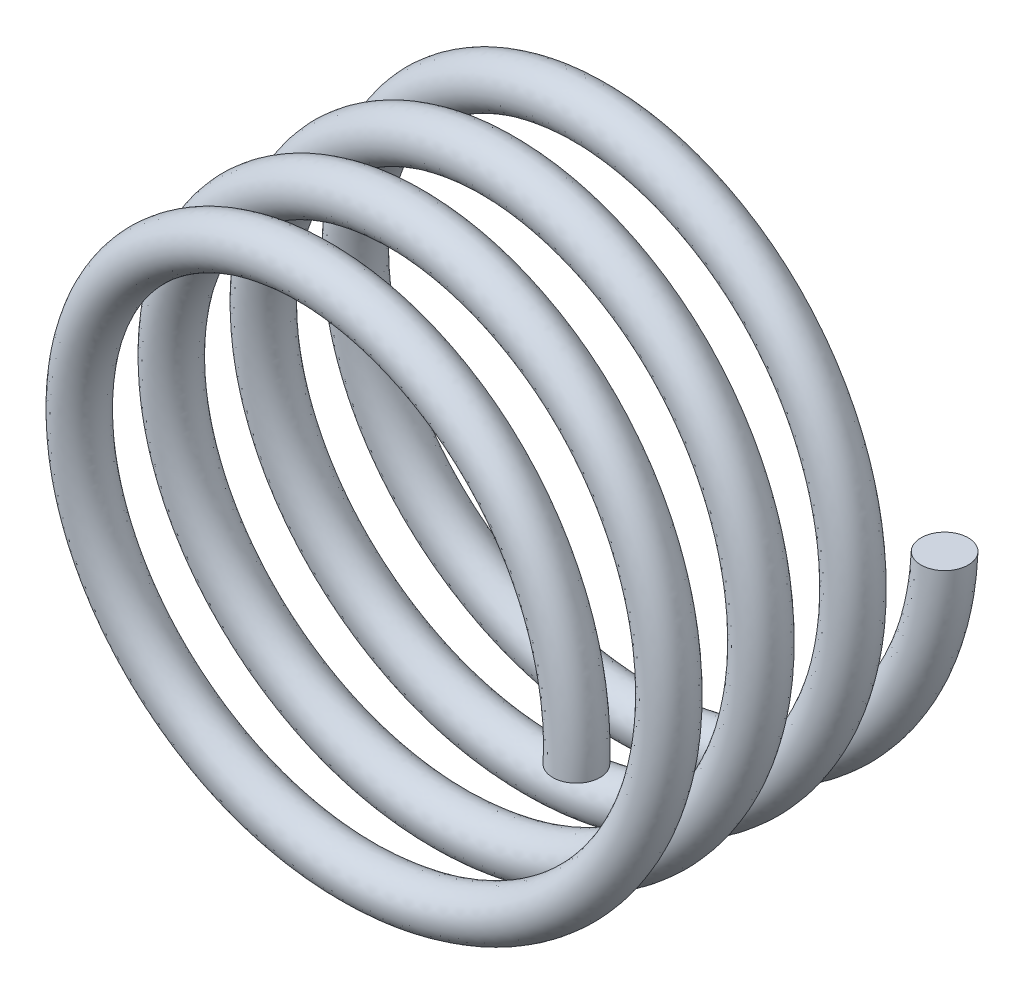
ISO-10303-21;
HEADER;
FILE_DESCRIPTION(('STEP AP214'),'2;1');
FILE_NAME('part.step','',(''),(''),'','','');
FILE_SCHEMA(('AUTOMOTIVE_DESIGN { 1 0 10303 214 1 1 1 1 }'));
ENDSEC;
DATA;
#1=APPLICATION_CONTEXT('core data for automotive mechanical design processes');
#2=APPLICATION_PROTOCOL_DEFINITION('international standard','automotive_design',2000,#1);
#3=PRODUCT_CONTEXT('',#1,'mechanical');
#4=PRODUCT('Part','Part','',(#3));
#5=PRODUCT_RELATED_PRODUCT_CATEGORY('part','',(#4));
#6=PRODUCT_DEFINITION_FORMATION('','',#4);
#7=PRODUCT_DEFINITION_CONTEXT('part definition',#1,'design');
#8=PRODUCT_DEFINITION('design','',#6,#7);
#9=PRODUCT_DEFINITION_SHAPE('','',#8);
#10=(LENGTH_UNIT() NAMED_UNIT(*) SI_UNIT(.MILLI.,.METRE.));
#11=(NAMED_UNIT(*) PLANE_ANGLE_UNIT() SI_UNIT($,.RADIAN.));
#12=(NAMED_UNIT(*) SI_UNIT($,.STERADIAN.) SOLID_ANGLE_UNIT());
#13=UNCERTAINTY_MEASURE_WITH_UNIT(LENGTH_MEASURE(1.E-05),#10,'distance_accuracy_value','');
#14=(GEOMETRIC_REPRESENTATION_CONTEXT(3) GLOBAL_UNCERTAINTY_ASSIGNED_CONTEXT((#13)) GLOBAL_UNIT_ASSIGNED_CONTEXT((#10,
#11,#12)) REPRESENTATION_CONTEXT('',''));
#15=CARTESIAN_POINT('',(0.,0.,0.));
#16=DIRECTION('',(0.,0.,1.));
#17=DIRECTION('',(1.,0.,0.));
#18=AXIS2_PLACEMENT_3D('',#15,#16,#17);
#19=CARTESIAN_POINT('',(8.763,0.,0.));
#20=DIRECTION('',(0.,1.,0.));
#21=DIRECTION('',(0.,0.,1.));
#22=AXIS2_PLACEMENT_3D('',#19,#20,#21);
#23=PLANE('',#22);
#24=CARTESIAN_POINT('',(8.763,0.,0.));
#25=DIRECTION('',(0.,1.,0.));
#26=DIRECTION('',(0.,0.,1.));
#27=AXIS2_PLACEMENT_3D('',#24,#25,#26);
#28=CIRCLE('',#27,0.762000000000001);
#29=CARTESIAN_POINT('',(8.763,0.,0.762000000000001));
#30=VERTEX_POINT('',#29);
#31=EDGE_CURVE('E37',#30,#30,#28,.T.);
#32=ORIENTED_EDGE('',*,*,#31,.T.);
#33=EDGE_LOOP('',(#32));
#34=FACE_BOUND('',#33,.T.);
#35=ADVANCED_FACE('F30',(#34),#23,.T.);
#36=CARTESIAN_POINT('',(8.763,-4.89533899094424E-13,11.8872));
#37=DIRECTION('',(0.,1.,0.));
#38=DIRECTION('',(0.,0.,1.));
#39=AXIS2_PLACEMENT_3D('',#36,#37,#38);
#40=PLANE('',#39);
#41=CARTESIAN_POINT('',(8.763,-4.89533899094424E-13,11.8872));
#42=DIRECTION('',(0.,1.,0.));
#43=DIRECTION('',(0.,0.,1.));
#44=AXIS2_PLACEMENT_3D('',#41,#42,#43);
#45=CIRCLE('',#44,0.762000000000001);
#46=CARTESIAN_POINT('',(8.763,-4.89533899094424E-13,12.6492));
#47=VERTEX_POINT('',#46);
#48=EDGE_CURVE('E11',#47,#47,#45,.T.);
#49=ORIENTED_EDGE('',*,*,#48,.F.);
#50=EDGE_LOOP('',(#49));
#51=FACE_BOUND('',#50,.T.);
#52=ADVANCED_FACE('F46',(#51),#40,.F.);
#53=CARTESIAN_POINT('',(8.763,0.,0.762000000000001));
#54=CARTESIAN_POINT('',(8.763,-5.05932040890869,1.00965));
#55=CARTESIAN_POINT('',(4.3815,-7.58898061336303,1.2573));
#56=CARTESIAN_POINT('',(0.,-10.1186408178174,1.50495));
#57=CARTESIAN_POINT('',(-4.3815,-7.58898061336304,1.7526));
#58=CARTESIAN_POINT('',(-8.76299999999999,-5.05932040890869,2.00025));
#59=CARTESIAN_POINT('',(-8.763,0.,2.2479));
#60=CARTESIAN_POINT('',(-8.763,5.05932040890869,2.49555));
#61=CARTESIAN_POINT('',(-4.3815,7.58898061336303,2.7432));
#62=CARTESIAN_POINT('',(0.,10.1186408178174,2.99085));
#63=CARTESIAN_POINT('',(4.38149999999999,7.58898061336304,3.2385));
#64=CARTESIAN_POINT('',(8.76299999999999,5.05932040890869,3.48614999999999));
#65=CARTESIAN_POINT('',(8.763,0.,3.7338));
#66=CARTESIAN_POINT('',(8.763,-5.05932040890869,3.98144999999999));
#67=CARTESIAN_POINT('',(4.3815,-7.58898061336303,4.22909999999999));
#68=CARTESIAN_POINT('',(0.,-10.1186408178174,4.47674999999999));
#69=CARTESIAN_POINT('',(-4.3815,-7.58898061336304,4.72439999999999));
#70=CARTESIAN_POINT('',(-8.76299999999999,-5.05932040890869,4.97204999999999));
#71=CARTESIAN_POINT('',(-8.763,0.,5.21969999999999));
#72=CARTESIAN_POINT('',(-8.763,5.05932040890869,5.46734999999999));
#73=CARTESIAN_POINT('',(-4.3815,7.58898061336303,5.71499999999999));
#74=CARTESIAN_POINT('',(0.,10.1186408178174,5.96264999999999));
#75=CARTESIAN_POINT('',(4.38149999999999,7.58898061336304,6.21029999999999));
#76=CARTESIAN_POINT('',(8.76299999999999,5.05932040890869,6.45794999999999));
#77=CARTESIAN_POINT('',(8.763,0.,6.70559999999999));
#78=CARTESIAN_POINT('',(8.763,-5.05932040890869,6.95324999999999));
#79=CARTESIAN_POINT('',(4.3815,-7.58898061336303,7.20089999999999));
#80=CARTESIAN_POINT('',(0.,-10.1186408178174,7.44854999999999));
#81=CARTESIAN_POINT('',(-4.3815,-7.58898061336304,7.69619999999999));
#82=CARTESIAN_POINT('',(-8.76299999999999,-5.05932040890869,7.94384999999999));
#83=CARTESIAN_POINT('',(-8.763,0.,8.19149999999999));
#84=CARTESIAN_POINT('',(-8.763,5.05932040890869,8.43914999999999));
#85=CARTESIAN_POINT('',(-4.3815,7.58898061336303,8.68679999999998));
#86=CARTESIAN_POINT('',(0.,10.1186408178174,8.93444999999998));
#87=CARTESIAN_POINT('',(4.38149999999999,7.58898061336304,9.18209999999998));
#88=CARTESIAN_POINT('',(8.76299999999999,5.05932040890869,9.42974999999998));
#89=CARTESIAN_POINT('',(8.763,0.,9.67739999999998));
#90=CARTESIAN_POINT('',(8.763,-5.05932040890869,9.92504999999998));
#91=CARTESIAN_POINT('',(4.3815,-7.58898061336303,10.1727));
#92=CARTESIAN_POINT('',(0.,-10.1186408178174,10.42035));
#93=CARTESIAN_POINT('',(-4.3815,-7.58898061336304,10.668));
#94=CARTESIAN_POINT('',(-8.76299999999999,-5.05932040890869,10.91565));
#95=CARTESIAN_POINT('',(-8.763,0.,11.1633));
#96=CARTESIAN_POINT('',(-8.763,5.05932040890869,11.41095));
#97=CARTESIAN_POINT('',(-4.3815,7.58898061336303,11.6586));
#98=CARTESIAN_POINT('',(0.,10.1186408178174,11.90625));
#99=CARTESIAN_POINT('',(4.38149999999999,7.58898061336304,12.1539));
#100=CARTESIAN_POINT('',(8.76299999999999,5.05932040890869,12.40155));
#101=CARTESIAN_POINT('',(8.763,0.,12.6492));
#102=CARTESIAN_POINT('',(10.287,0.,0.762000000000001));
#103=CARTESIAN_POINT('',(10.287,-5.93920221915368,1.00965));
#104=CARTESIAN_POINT('',(5.1435,-8.90880332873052,1.2573));
#105=CARTESIAN_POINT('',(0.,-11.8784044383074,1.50495));
#106=CARTESIAN_POINT('',(-5.1435,-8.90880332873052,1.7526));
#107=CARTESIAN_POINT('',(-10.287,-5.93920221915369,2.00025));
#108=CARTESIAN_POINT('',(-10.287,0.,2.2479));
#109=CARTESIAN_POINT('',(-10.287,5.93920221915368,2.49555));
#110=CARTESIAN_POINT('',(-5.1435,8.90880332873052,2.7432));
#111=CARTESIAN_POINT('',(0.,11.8784044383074,2.99085));
#112=CARTESIAN_POINT('',(5.14349999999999,8.90880332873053,3.2385));
#113=CARTESIAN_POINT('',(10.287,5.93920221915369,3.48615));
#114=CARTESIAN_POINT('',(10.287,0.,3.7338));
#115=CARTESIAN_POINT('',(10.287,-5.93920221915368,3.98144999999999));
#116=CARTESIAN_POINT('',(5.1435,-8.90880332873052,4.22909999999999));
#117=CARTESIAN_POINT('',(0.,-11.8784044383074,4.47674999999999));
#118=CARTESIAN_POINT('',(-5.1435,-8.90880332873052,4.72439999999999));
#119=CARTESIAN_POINT('',(-10.287,-5.93920221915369,4.97204999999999));
#120=CARTESIAN_POINT('',(-10.287,0.,5.21969999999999));
#121=CARTESIAN_POINT('',(-10.287,5.93920221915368,5.46734999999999));
#122=CARTESIAN_POINT('',(-5.1435,8.90880332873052,5.71499999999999));
#123=CARTESIAN_POINT('',(0.,11.8784044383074,5.96264999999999));
#124=CARTESIAN_POINT('',(5.14349999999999,8.90880332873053,6.21029999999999));
#125=CARTESIAN_POINT('',(10.287,5.93920221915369,6.45794999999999));
#126=CARTESIAN_POINT('',(10.287,0.,6.70559999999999));
#127=CARTESIAN_POINT('',(10.287,-5.93920221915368,6.95324999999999));
#128=CARTESIAN_POINT('',(5.1435,-8.90880332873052,7.20089999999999));
#129=CARTESIAN_POINT('',(0.,-11.8784044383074,7.44854999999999));
#130=CARTESIAN_POINT('',(-5.1435,-8.90880332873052,7.69619999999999));
#131=CARTESIAN_POINT('',(-10.287,-5.93920221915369,7.94384999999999));
#132=CARTESIAN_POINT('',(-10.287,0.,8.19149999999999));
#133=CARTESIAN_POINT('',(-10.287,5.93920221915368,8.43914999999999));
#134=CARTESIAN_POINT('',(-5.1435,8.90880332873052,8.68679999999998));
#135=CARTESIAN_POINT('',(0.,11.8784044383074,8.93444999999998));
#136=CARTESIAN_POINT('',(5.14349999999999,8.90880332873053,9.18209999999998));
#137=CARTESIAN_POINT('',(10.287,5.93920221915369,9.42974999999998));
#138=CARTESIAN_POINT('',(10.287,0.,9.67739999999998));
#139=CARTESIAN_POINT('',(10.287,-5.93920221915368,9.92504999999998));
#140=CARTESIAN_POINT('',(5.1435,-8.90880332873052,10.1727));
#141=CARTESIAN_POINT('',(0.,-11.8784044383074,10.42035));
#142=CARTESIAN_POINT('',(-5.1435,-8.90880332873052,10.668));
#143=CARTESIAN_POINT('',(-10.287,-5.93920221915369,10.91565));
#144=CARTESIAN_POINT('',(-10.287,0.,11.1633));
#145=CARTESIAN_POINT('',(-10.287,5.93920221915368,11.41095));
#146=CARTESIAN_POINT('',(-5.1435,8.90880332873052,11.6586));
#147=CARTESIAN_POINT('',(0.,11.8784044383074,11.90625));
#148=CARTESIAN_POINT('',(5.14349999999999,8.90880332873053,12.1539));
#149=CARTESIAN_POINT('',(10.287,5.93920221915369,12.40155));
#150=CARTESIAN_POINT('',(10.287,0.,12.6492));
#151=CARTESIAN_POINT('',(10.287,0.,-0.762000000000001));
#152=CARTESIAN_POINT('',(10.287,-5.93920221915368,-0.514350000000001));
#153=CARTESIAN_POINT('',(5.1435,-8.90880332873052,-0.266700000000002));
#154=CARTESIAN_POINT('',(0.,-11.8784044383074,-0.0190500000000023));
#155=CARTESIAN_POINT('',(-5.1435,-8.90880332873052,0.228599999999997));
#156=CARTESIAN_POINT('',(-10.287,-5.93920221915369,0.476249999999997));
#157=CARTESIAN_POINT('',(-10.287,0.,0.723899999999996));
#158=CARTESIAN_POINT('',(-10.287,5.93920221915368,0.971549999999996));
#159=CARTESIAN_POINT('',(-5.1435,8.90880332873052,1.21919999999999));
#160=CARTESIAN_POINT('',(0.,11.8784044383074,1.46684999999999));
#161=CARTESIAN_POINT('',(5.14349999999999,8.90880332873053,1.71449999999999));
#162=CARTESIAN_POINT('',(10.287,5.93920221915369,1.96214999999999));
#163=CARTESIAN_POINT('',(10.287,0.,2.20979999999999));
#164=CARTESIAN_POINT('',(10.287,-5.93920221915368,2.45744999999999));
#165=CARTESIAN_POINT('',(5.1435,-8.90880332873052,2.70509999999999));
#166=CARTESIAN_POINT('',(0.,-11.8784044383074,2.95274999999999));
#167=CARTESIAN_POINT('',(-5.1435,-8.90880332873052,3.20039999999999));
#168=CARTESIAN_POINT('',(-10.287,-5.93920221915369,3.44804999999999));
#169=CARTESIAN_POINT('',(-10.287,0.,3.69569999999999));
#170=CARTESIAN_POINT('',(-10.287,5.93920221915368,3.94334999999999));
#171=CARTESIAN_POINT('',(-5.1435,8.90880332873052,4.19099999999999));
#172=CARTESIAN_POINT('',(0.,11.8784044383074,4.43864999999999));
#173=CARTESIAN_POINT('',(5.14349999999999,8.90880332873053,4.68629999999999));
#174=CARTESIAN_POINT('',(10.287,5.93920221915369,4.93394999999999));
#175=CARTESIAN_POINT('',(10.287,0.,5.18159999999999));
#176=CARTESIAN_POINT('',(10.287,-5.93920221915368,5.42924999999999));
#177=CARTESIAN_POINT('',(5.1435,-8.90880332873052,5.67689999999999));
#178=CARTESIAN_POINT('',(0.,-11.8784044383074,5.92454999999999));
#179=CARTESIAN_POINT('',(-5.1435,-8.90880332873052,6.17219999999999));
#180=CARTESIAN_POINT('',(-10.287,-5.93920221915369,6.41984999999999));
#181=CARTESIAN_POINT('',(-10.287,0.,6.66749999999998));
#182=CARTESIAN_POINT('',(-10.287,5.93920221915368,6.91514999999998));
#183=CARTESIAN_POINT('',(-5.1435,8.90880332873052,7.16279999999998));
#184=CARTESIAN_POINT('',(0.,11.8784044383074,7.41044999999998));
#185=CARTESIAN_POINT('',(5.14349999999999,8.90880332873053,7.65809999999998));
#186=CARTESIAN_POINT('',(10.287,5.93920221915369,7.90574999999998));
#187=CARTESIAN_POINT('',(10.287,0.,8.15339999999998));
#188=CARTESIAN_POINT('',(10.287,-5.93920221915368,8.40104999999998));
#189=CARTESIAN_POINT('',(5.1435,-8.90880332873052,8.64869999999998));
#190=CARTESIAN_POINT('',(0.,-11.8784044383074,8.89634999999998));
#191=CARTESIAN_POINT('',(-5.1435,-8.90880332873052,9.14399999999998));
#192=CARTESIAN_POINT('',(-10.287,-5.93920221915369,9.39164999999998));
#193=CARTESIAN_POINT('',(-10.287,0.,9.63929999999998));
#194=CARTESIAN_POINT('',(-10.287,5.93920221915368,9.88694999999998));
#195=CARTESIAN_POINT('',(-5.1435,8.90880332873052,10.1346));
#196=CARTESIAN_POINT('',(0.,11.8784044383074,10.38225));
#197=CARTESIAN_POINT('',(5.14349999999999,8.90880332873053,10.6299));
#198=CARTESIAN_POINT('',(10.287,5.93920221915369,10.87755));
#199=CARTESIAN_POINT('',(10.287,0.,11.1252));
#200=CARTESIAN_POINT('',(8.763,0.,-0.762000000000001));
#201=CARTESIAN_POINT('',(8.763,-5.05932040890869,-0.514350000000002));
#202=CARTESIAN_POINT('',(4.3815,-7.58898061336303,-0.266700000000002));
#203=CARTESIAN_POINT('',(0.,-10.1186408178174,-0.0190500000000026));
#204=CARTESIAN_POINT('',(-4.3815,-7.58898061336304,0.228599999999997));
#205=CARTESIAN_POINT('',(-8.76299999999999,-5.05932040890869,0.476249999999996));
#206=CARTESIAN_POINT('',(-8.763,0.,0.723899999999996));
#207=CARTESIAN_POINT('',(-8.763,5.05932040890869,0.971549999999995));
#208=CARTESIAN_POINT('',(-4.3815,7.58898061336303,1.21919999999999));
#209=CARTESIAN_POINT('',(0.,10.1186408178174,1.46684999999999));
#210=CARTESIAN_POINT('',(4.38149999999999,7.58898061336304,1.71449999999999));
#211=CARTESIAN_POINT('',(8.76299999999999,5.05932040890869,1.96214999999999));
#212=CARTESIAN_POINT('',(8.763,0.,2.20979999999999));
#213=CARTESIAN_POINT('',(8.763,-5.05932040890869,2.45744999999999));
#214=CARTESIAN_POINT('',(4.3815,-7.58898061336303,2.70509999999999));
#215=CARTESIAN_POINT('',(0.,-10.1186408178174,2.95274999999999));
#216=CARTESIAN_POINT('',(-4.3815,-7.58898061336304,3.20039999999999));
#217=CARTESIAN_POINT('',(-8.76299999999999,-5.05932040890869,3.44804999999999));
#218=CARTESIAN_POINT('',(-8.763,0.,3.69569999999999));
#219=CARTESIAN_POINT('',(-8.763,5.05932040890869,3.94334999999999));
#220=CARTESIAN_POINT('',(-4.3815,7.58898061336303,4.19099999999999));
#221=CARTESIAN_POINT('',(0.,10.1186408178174,4.43864999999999));
#222=CARTESIAN_POINT('',(4.38149999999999,7.58898061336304,4.68629999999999));
#223=CARTESIAN_POINT('',(8.76299999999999,5.05932040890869,4.93394999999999));
#224=CARTESIAN_POINT('',(8.763,0.,5.18159999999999));
#225=CARTESIAN_POINT('',(8.763,-5.05932040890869,5.42924999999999));
#226=CARTESIAN_POINT('',(4.3815,-7.58898061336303,5.67689999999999));
#227=CARTESIAN_POINT('',(0.,-10.1186408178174,5.92454999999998));
#228=CARTESIAN_POINT('',(-4.3815,-7.58898061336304,6.17219999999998));
#229=CARTESIAN_POINT('',(-8.76299999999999,-5.05932040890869,6.41984999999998));
#230=CARTESIAN_POINT('',(-8.763,0.,6.66749999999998));
#231=CARTESIAN_POINT('',(-8.763,5.05932040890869,6.91514999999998));
#232=CARTESIAN_POINT('',(-4.3815,7.58898061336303,7.16279999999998));
#233=CARTESIAN_POINT('',(0.,10.1186408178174,7.41044999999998));
#234=CARTESIAN_POINT('',(4.38149999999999,7.58898061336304,7.65809999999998));
#235=CARTESIAN_POINT('',(8.76299999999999,5.05932040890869,7.90574999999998));
#236=CARTESIAN_POINT('',(8.763,0.,8.15339999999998));
#237=CARTESIAN_POINT('',(8.763,-5.05932040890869,8.40104999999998));
#238=CARTESIAN_POINT('',(4.3815,-7.58898061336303,8.64869999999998));
#239=CARTESIAN_POINT('',(0.,-10.1186408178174,8.89634999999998));
#240=CARTESIAN_POINT('',(-4.3815,-7.58898061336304,9.14399999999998));
#241=CARTESIAN_POINT('',(-8.76299999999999,-5.05932040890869,9.39164999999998));
#242=CARTESIAN_POINT('',(-8.763,0.,9.63929999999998));
#243=CARTESIAN_POINT('',(-8.763,5.05932040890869,9.88694999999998));
#244=CARTESIAN_POINT('',(-4.3815,7.58898061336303,10.1346));
#245=CARTESIAN_POINT('',(0.,10.1186408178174,10.38225));
#246=CARTESIAN_POINT('',(4.38149999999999,7.58898061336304,10.6299));
#247=CARTESIAN_POINT('',(8.76299999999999,5.05932040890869,10.87755));
#248=CARTESIAN_POINT('',(8.763,0.,11.1252));
#249=CARTESIAN_POINT('',(7.239,0.,-0.762000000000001));
#250=CARTESIAN_POINT('',(7.239,-4.1794385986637,-0.514350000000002));
#251=CARTESIAN_POINT('',(3.6195,-6.26915789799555,-0.266700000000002));
#252=CARTESIAN_POINT('',(0.,-8.3588771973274,-0.0190500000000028));
#253=CARTESIAN_POINT('',(-3.6195,-6.26915789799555,0.228599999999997));
#254=CARTESIAN_POINT('',(-7.23899999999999,-4.1794385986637,0.476249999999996));
#255=CARTESIAN_POINT('',(-7.239,0.,0.723899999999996));
#256=CARTESIAN_POINT('',(-7.239,4.1794385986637,0.971549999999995));
#257=CARTESIAN_POINT('',(-3.6195,6.26915789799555,1.21919999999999));
#258=CARTESIAN_POINT('',(0.,8.3588771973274,1.46684999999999));
#259=CARTESIAN_POINT('',(3.61949999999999,6.26915789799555,1.71449999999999));
#260=CARTESIAN_POINT('',(7.23899999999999,4.1794385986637,1.96214999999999));
#261=CARTESIAN_POINT('',(7.239,0.,2.20979999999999));
#262=CARTESIAN_POINT('',(7.239,-4.1794385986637,2.45744999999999));
#263=CARTESIAN_POINT('',(3.6195,-6.26915789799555,2.70509999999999));
#264=CARTESIAN_POINT('',(0.,-8.3588771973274,2.95274999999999));
#265=CARTESIAN_POINT('',(-3.6195,-6.26915789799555,3.20039999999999));
#266=CARTESIAN_POINT('',(-7.23899999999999,-4.1794385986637,3.44804999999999));
#267=CARTESIAN_POINT('',(-7.239,0.,3.69569999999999));
#268=CARTESIAN_POINT('',(-7.239,4.1794385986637,3.94334999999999));
#269=CARTESIAN_POINT('',(-3.6195,6.26915789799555,4.19099999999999));
#270=CARTESIAN_POINT('',(0.,8.3588771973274,4.43864999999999));
#271=CARTESIAN_POINT('',(3.61949999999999,6.26915789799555,4.68629999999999));
#272=CARTESIAN_POINT('',(7.23899999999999,4.1794385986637,4.93394999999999));
#273=CARTESIAN_POINT('',(7.239,0.,5.18159999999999));
#274=CARTESIAN_POINT('',(7.239,-4.1794385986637,5.42924999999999));
#275=CARTESIAN_POINT('',(3.6195,-6.26915789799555,5.67689999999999));
#276=CARTESIAN_POINT('',(0.,-8.3588771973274,5.92454999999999));
#277=CARTESIAN_POINT('',(-3.6195,-6.26915789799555,6.17219999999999));
#278=CARTESIAN_POINT('',(-7.23899999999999,-4.1794385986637,6.41984999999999));
#279=CARTESIAN_POINT('',(-7.239,0.,6.66749999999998));
#280=CARTESIAN_POINT('',(-7.239,4.1794385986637,6.91514999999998));
#281=CARTESIAN_POINT('',(-3.6195,6.26915789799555,7.16279999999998));
#282=CARTESIAN_POINT('',(0.,8.3588771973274,7.41044999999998));
#283=CARTESIAN_POINT('',(3.61949999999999,6.26915789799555,7.65809999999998));
#284=CARTESIAN_POINT('',(7.23899999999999,4.1794385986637,7.90574999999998));
#285=CARTESIAN_POINT('',(7.239,0.,8.15339999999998));
#286=CARTESIAN_POINT('',(7.239,-4.1794385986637,8.40104999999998));
#287=CARTESIAN_POINT('',(3.6195,-6.26915789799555,8.64869999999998));
#288=CARTESIAN_POINT('',(0.,-8.3588771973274,8.89634999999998));
#289=CARTESIAN_POINT('',(-3.6195,-6.26915789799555,9.14399999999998));
#290=CARTESIAN_POINT('',(-7.23899999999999,-4.1794385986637,9.39164999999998));
#291=CARTESIAN_POINT('',(-7.239,0.,9.63929999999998));
#292=CARTESIAN_POINT('',(-7.239,4.1794385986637,9.88694999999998));
#293=CARTESIAN_POINT('',(-3.6195,6.26915789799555,10.1346));
#294=CARTESIAN_POINT('',(0.,8.3588771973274,10.38225));
#295=CARTESIAN_POINT('',(3.61949999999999,6.26915789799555,10.6299));
#296=CARTESIAN_POINT('',(7.23899999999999,4.1794385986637,10.87755));
#297=CARTESIAN_POINT('',(7.239,0.,11.1252));
#298=CARTESIAN_POINT('',(7.239,0.,0.762000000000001));
#299=CARTESIAN_POINT('',(7.239,-4.1794385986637,1.00965));
#300=CARTESIAN_POINT('',(3.6195,-6.26915789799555,1.2573));
#301=CARTESIAN_POINT('',(0.,-8.3588771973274,1.50495));
#302=CARTESIAN_POINT('',(-3.6195,-6.26915789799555,1.7526));
#303=CARTESIAN_POINT('',(-7.23899999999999,-4.1794385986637,2.00025));
#304=CARTESIAN_POINT('',(-7.239,0.,2.2479));
#305=CARTESIAN_POINT('',(-7.239,4.1794385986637,2.49555));
#306=CARTESIAN_POINT('',(-3.6195,6.26915789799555,2.7432));
#307=CARTESIAN_POINT('',(0.,8.3588771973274,2.99085));
#308=CARTESIAN_POINT('',(3.61949999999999,6.26915789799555,3.2385));
#309=CARTESIAN_POINT('',(7.23899999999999,4.1794385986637,3.48615));
#310=CARTESIAN_POINT('',(7.239,0.,3.7338));
#311=CARTESIAN_POINT('',(7.239,-4.1794385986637,3.98144999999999));
#312=CARTESIAN_POINT('',(3.6195,-6.26915789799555,4.22909999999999));
#313=CARTESIAN_POINT('',(0.,-8.3588771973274,4.47674999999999));
#314=CARTESIAN_POINT('',(-3.6195,-6.26915789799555,4.72439999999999));
#315=CARTESIAN_POINT('',(-7.23899999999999,-4.1794385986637,4.97204999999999));
#316=CARTESIAN_POINT('',(-7.239,0.,5.21969999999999));
#317=CARTESIAN_POINT('',(-7.239,4.1794385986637,5.46734999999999));
#318=CARTESIAN_POINT('',(-3.6195,6.26915789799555,5.71499999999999));
#319=CARTESIAN_POINT('',(0.,8.3588771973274,5.96264999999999));
#320=CARTESIAN_POINT('',(3.61949999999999,6.26915789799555,6.21029999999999));
#321=CARTESIAN_POINT('',(7.23899999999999,4.1794385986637,6.45794999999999));
#322=CARTESIAN_POINT('',(7.239,0.,6.70559999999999));
#323=CARTESIAN_POINT('',(7.239,-4.1794385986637,6.95324999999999));
#324=CARTESIAN_POINT('',(3.6195,-6.26915789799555,7.20089999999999));
#325=CARTESIAN_POINT('',(0.,-8.3588771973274,7.44854999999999));
#326=CARTESIAN_POINT('',(-3.6195,-6.26915789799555,7.69619999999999));
#327=CARTESIAN_POINT('',(-7.23899999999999,-4.1794385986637,7.94384999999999));
#328=CARTESIAN_POINT('',(-7.239,0.,8.19149999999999));
#329=CARTESIAN_POINT('',(-7.239,4.1794385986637,8.43914999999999));
#330=CARTESIAN_POINT('',(-3.6195,6.26915789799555,8.68679999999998));
#331=CARTESIAN_POINT('',(0.,8.3588771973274,8.93444999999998));
#332=CARTESIAN_POINT('',(3.61949999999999,6.26915789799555,9.18209999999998));
#333=CARTESIAN_POINT('',(7.23899999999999,4.1794385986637,9.42974999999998));
#334=CARTESIAN_POINT('',(7.239,0.,9.67739999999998));
#335=CARTESIAN_POINT('',(7.239,-4.1794385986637,9.92504999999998));
#336=CARTESIAN_POINT('',(3.6195,-6.26915789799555,10.1727));
#337=CARTESIAN_POINT('',(0.,-8.3588771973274,10.42035));
#338=CARTESIAN_POINT('',(-3.6195,-6.26915789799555,10.668));
#339=CARTESIAN_POINT('',(-7.23899999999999,-4.1794385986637,10.91565));
#340=CARTESIAN_POINT('',(-7.239,0.,11.1633));
#341=CARTESIAN_POINT('',(-7.239,4.1794385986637,11.41095));
#342=CARTESIAN_POINT('',(-3.6195,6.26915789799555,11.6586));
#343=CARTESIAN_POINT('',(0.,8.3588771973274,11.90625));
#344=CARTESIAN_POINT('',(3.61949999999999,6.26915789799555,12.1539));
#345=CARTESIAN_POINT('',(7.23899999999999,4.1794385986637,12.40155));
#346=CARTESIAN_POINT('',(7.239,0.,12.6492));
#347=CARTESIAN_POINT('',(8.763,0.,0.762000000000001));
#348=CARTESIAN_POINT('',(8.763,-5.05932040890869,1.00965));
#349=CARTESIAN_POINT('',(4.3815,-7.58898061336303,1.2573));
#350=CARTESIAN_POINT('',(0.,-10.1186408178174,1.50495));
#351=CARTESIAN_POINT('',(-4.3815,-7.58898061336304,1.7526));
#352=CARTESIAN_POINT('',(-8.76299999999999,-5.05932040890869,2.00025));
#353=CARTESIAN_POINT('',(-8.763,0.,2.2479));
#354=CARTESIAN_POINT('',(-8.763,5.05932040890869,2.49555));
#355=CARTESIAN_POINT('',(-4.3815,7.58898061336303,2.7432));
#356=CARTESIAN_POINT('',(0.,10.1186408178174,2.99085));
#357=CARTESIAN_POINT('',(4.38149999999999,7.58898061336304,3.2385));
#358=CARTESIAN_POINT('',(8.76299999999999,5.05932040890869,3.48614999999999));
#359=CARTESIAN_POINT('',(8.763,0.,3.7338));
#360=CARTESIAN_POINT('',(8.763,-5.05932040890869,3.98144999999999));
#361=CARTESIAN_POINT('',(4.3815,-7.58898061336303,4.22909999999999));
#362=CARTESIAN_POINT('',(0.,-10.1186408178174,4.47674999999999));
#363=CARTESIAN_POINT('',(-4.3815,-7.58898061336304,4.72439999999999));
#364=CARTESIAN_POINT('',(-8.76299999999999,-5.05932040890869,4.97204999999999));
#365=CARTESIAN_POINT('',(-8.763,0.,5.21969999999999));
#366=CARTESIAN_POINT('',(-8.763,5.05932040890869,5.46734999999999));
#367=CARTESIAN_POINT('',(-4.3815,7.58898061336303,5.71499999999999));
#368=CARTESIAN_POINT('',(0.,10.1186408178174,5.96264999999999));
#369=CARTESIAN_POINT('',(4.38149999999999,7.58898061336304,6.21029999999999));
#370=CARTESIAN_POINT('',(8.76299999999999,5.05932040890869,6.45794999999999));
#371=CARTESIAN_POINT('',(8.763,0.,6.70559999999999));
#372=CARTESIAN_POINT('',(8.763,-5.05932040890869,6.95324999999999));
#373=CARTESIAN_POINT('',(4.3815,-7.58898061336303,7.20089999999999));
#374=CARTESIAN_POINT('',(0.,-10.1186408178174,7.44854999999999));
#375=CARTESIAN_POINT('',(-4.3815,-7.58898061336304,7.69619999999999));
#376=CARTESIAN_POINT('',(-8.76299999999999,-5.05932040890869,7.94384999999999));
#377=CARTESIAN_POINT('',(-8.763,0.,8.19149999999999));
#378=CARTESIAN_POINT('',(-8.763,5.05932040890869,8.43914999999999));
#379=CARTESIAN_POINT('',(-4.3815,7.58898061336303,8.68679999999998));
#380=CARTESIAN_POINT('',(0.,10.1186408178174,8.93444999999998));
#381=CARTESIAN_POINT('',(4.38149999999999,7.58898061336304,9.18209999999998));
#382=CARTESIAN_POINT('',(8.76299999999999,5.05932040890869,9.42974999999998));
#383=CARTESIAN_POINT('',(8.763,0.,9.67739999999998));
#384=CARTESIAN_POINT('',(8.763,-5.05932040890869,9.92504999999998));
#385=CARTESIAN_POINT('',(4.3815,-7.58898061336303,10.1727));
#386=CARTESIAN_POINT('',(0.,-10.1186408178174,10.42035));
#387=CARTESIAN_POINT('',(-4.3815,-7.58898061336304,10.668));
#388=CARTESIAN_POINT('',(-8.76299999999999,-5.05932040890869,10.91565));
#389=CARTESIAN_POINT('',(-8.763,0.,11.1633));
#390=CARTESIAN_POINT('',(-8.763,5.05932040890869,11.41095));
#391=CARTESIAN_POINT('',(-4.3815,7.58898061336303,11.6586));
#392=CARTESIAN_POINT('',(0.,10.1186408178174,11.90625));
#393=CARTESIAN_POINT('',(4.38149999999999,7.58898061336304,12.1539));
#394=CARTESIAN_POINT('',(8.76299999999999,5.05932040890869,12.40155));
#395=CARTESIAN_POINT('',(8.763,0.,12.6492));
#396=(BOUNDED_SURFACE() B_SPLINE_SURFACE(3,2,((#53,#54,#55,#56,#57,#58,#59,#60,#61,#62,#63,#64,
#65,#66,#67,#68,#69,#70,#71,#72,#73,#74,#75,#76,#77,#78,#79,#80,#81,#82,#83,#84,#85,#86,#87,#88,
#89,#90,#91,#92,#93,#94,#95,#96,#97,#98,#99,#100,#101),(#102,#103,#104,#105,#106,#107,#108,#109,
#110,#111,#112,#113,#114,#115,#116,#117,#118,#119,#120,#121,#122,#123,#124,#125,#126,#127,#128,
#129,#130,#131,#132,#133,#134,#135,#136,#137,#138,#139,#140,#141,#142,#143,#144,#145,#146,#147,
#148,#149,#150),(#151,#152,#153,#154,#155,#156,#157,#158,#159,#160,#161,#162,#163,#164,#165,
#166,#167,#168,#169,#170,#171,#172,#173,#174,#175,#176,#177,#178,#179,#180,#181,#182,#183,#184,
#185,#186,#187,#188,#189,#190,#191,#192,#193,#194,#195,#196,#197,#198,#199),(#200,#201,#202,
#203,#204,#205,#206,#207,#208,#209,#210,#211,#212,#213,#214,#215,#216,#217,#218,#219,#220,#221,
#222,#223,#224,#225,#226,#227,#228,#229,#230,#231,#232,#233,#234,#235,#236,#237,#238,#239,#240,
#241,#242,#243,#244,#245,#246,#247,#248),(#249,#250,#251,#252,#253,#254,#255,#256,#257,#258,
#259,#260,#261,#262,#263,#264,#265,#266,#267,#268,#269,#270,#271,#272,#273,#274,#275,#276,#277,
#278,#279,#280,#281,#282,#283,#284,#285,#286,#287,#288,#289,#290,#291,#292,#293,#294,#295,#296,
#297),(#298,#299,#300,#301,#302,#303,#304,#305,#306,#307,#308,#309,#310,#311,#312,#313,#314,
#315,#316,#317,#318,#319,#320,#321,#322,#323,#324,#325,#326,#327,#328,#329,#330,#331,#332,#333,
#334,#335,#336,#337,#338,#339,#340,#341,#342,#343,#344,#345,#346),(#347,#348,#349,#350,#351,
#352,#353,#354,#355,#356,#357,#358,#359,#360,#361,#362,#363,#364,#365,#366,#367,#368,#369,#370,
#371,#372,#373,#374,#375,#376,#377,#378,#379,#380,#381,#382,#383,#384,#385,#386,#387,#388,#389,
#390,#391,#392,#393,#394,#395)),.UNSPECIFIED.,.T.,.F.,.F.) B_SPLINE_SURFACE_WITH_KNOTS((4,3,4),
(3,2,2,2,2,2,2,2,2,2,2,2,2,2,2,2,2,2,2,2,2,2,2,2,3),(0.,0.5,1.),(0.,0.0416666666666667,
0.0833333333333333,0.125,0.166666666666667,0.208333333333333,0.25,0.291666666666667,
0.333333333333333,0.375,0.416666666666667,0.458333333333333,0.5,0.541666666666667,
0.583333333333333,0.625,0.666666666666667,0.708333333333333,0.75,0.791666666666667,
0.833333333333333,0.875,0.916666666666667,0.958333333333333,1.),
.UNSPECIFIED.) GEOMETRIC_REPRESENTATION_ITEM() RATIONAL_B_SPLINE_SURFACE(((1.,0.866025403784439,
1.,0.866025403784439,1.,0.866025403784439,1.,0.866025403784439,1.,0.866025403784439,1.,
0.866025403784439,1.,0.866025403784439,1.,0.866025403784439,1.,0.866025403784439,1.,
0.866025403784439,1.,0.866025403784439,1.,0.866025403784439,1.,0.866025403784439,1.,
0.866025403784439,1.,0.866025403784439,1.,0.866025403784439,1.,0.866025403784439,1.,
0.866025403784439,1.,0.866025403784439,1.,0.866025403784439,1.,0.866025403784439,1.,
0.866025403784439,1.,0.866025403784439,1.,0.866025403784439,1.),(0.333333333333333,
0.288675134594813,0.333333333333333,0.288675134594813,0.333333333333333,0.288675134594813,
0.333333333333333,0.288675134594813,0.333333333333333,0.288675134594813,0.333333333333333,
0.288675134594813,0.333333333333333,0.288675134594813,0.333333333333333,0.288675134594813,
0.333333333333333,0.288675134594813,0.333333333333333,0.288675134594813,0.333333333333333,
0.288675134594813,0.333333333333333,0.288675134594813,0.333333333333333,0.288675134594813,
0.333333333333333,0.288675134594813,0.333333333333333,0.288675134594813,0.333333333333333,
0.288675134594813,0.333333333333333,0.288675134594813,0.333333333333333,0.288675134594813,
0.333333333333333,0.288675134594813,0.333333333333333,0.288675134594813,0.333333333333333,
0.288675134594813,0.333333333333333,0.288675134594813,0.333333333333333,0.288675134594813,
0.333333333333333,0.288675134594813,0.333333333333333),(0.333333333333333,0.288675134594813,
0.333333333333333,0.288675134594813,0.333333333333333,0.288675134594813,0.333333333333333,
0.288675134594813,0.333333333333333,0.288675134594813,0.333333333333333,0.288675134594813,
0.333333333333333,0.288675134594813,0.333333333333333,0.288675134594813,0.333333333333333,
0.288675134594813,0.333333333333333,0.288675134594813,0.333333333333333,0.288675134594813,
0.333333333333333,0.288675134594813,0.333333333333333,0.288675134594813,0.333333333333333,
0.288675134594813,0.333333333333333,0.288675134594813,0.333333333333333,0.288675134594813,
0.333333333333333,0.288675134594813,0.333333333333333,0.288675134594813,0.333333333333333,
0.288675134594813,0.333333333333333,0.288675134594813,0.333333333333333,0.288675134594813,
0.333333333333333,0.288675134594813,0.333333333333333,0.288675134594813,0.333333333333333,
0.288675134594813,0.333333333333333),(1.,0.866025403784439,1.,0.866025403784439,1.,
0.866025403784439,1.,0.866025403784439,1.,0.866025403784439,1.,0.866025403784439,1.,
0.866025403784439,1.,0.866025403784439,1.,0.866025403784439,1.,0.866025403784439,1.,
0.866025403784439,1.,0.866025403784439,1.,0.866025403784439,1.,0.866025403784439,1.,
0.866025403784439,1.,0.866025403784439,1.,0.866025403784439,1.,0.866025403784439,1.,
0.866025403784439,1.,0.866025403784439,1.,0.866025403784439,1.,0.866025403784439,1.,
0.866025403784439,1.,0.866025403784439,1.),(0.333333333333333,0.288675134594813,
0.333333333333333,0.288675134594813,0.333333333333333,0.288675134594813,0.333333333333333,
0.288675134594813,0.333333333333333,0.288675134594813,0.333333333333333,0.288675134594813,
0.333333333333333,0.288675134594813,0.333333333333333,0.288675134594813,0.333333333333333,
0.288675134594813,0.333333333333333,0.288675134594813,0.333333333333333,0.288675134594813,
0.333333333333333,0.288675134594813,0.333333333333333,0.288675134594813,0.333333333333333,
0.288675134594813,0.333333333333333,0.288675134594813,0.333333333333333,0.288675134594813,
0.333333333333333,0.288675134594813,0.333333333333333,0.288675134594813,0.333333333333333,
0.288675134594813,0.333333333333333,0.288675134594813,0.333333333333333,0.288675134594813,
0.333333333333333,0.288675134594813,0.333333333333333,0.288675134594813,0.333333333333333,
0.288675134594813,0.333333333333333),(0.333333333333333,0.288675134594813,0.333333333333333,
0.288675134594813,0.333333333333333,0.288675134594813,0.333333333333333,0.288675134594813,
0.333333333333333,0.288675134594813,0.333333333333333,0.288675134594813,0.333333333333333,
0.288675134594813,0.333333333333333,0.288675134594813,0.333333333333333,0.288675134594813,
0.333333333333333,0.288675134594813,0.333333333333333,0.288675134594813,0.333333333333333,
0.288675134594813,0.333333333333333,0.288675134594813,0.333333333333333,0.288675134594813,
0.333333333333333,0.288675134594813,0.333333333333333,0.288675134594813,0.333333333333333,
0.288675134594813,0.333333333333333,0.288675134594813,0.333333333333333,0.288675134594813,
0.333333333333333,0.288675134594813,0.333333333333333,0.288675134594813,0.333333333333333,
0.288675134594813,0.333333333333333,0.288675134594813,0.333333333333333,0.288675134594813,
0.333333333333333),(1.,0.866025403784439,1.,0.866025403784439,1.,0.866025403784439,1.,
0.866025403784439,1.,0.866025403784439,1.,0.866025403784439,1.,0.866025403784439,1.,
0.866025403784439,1.,0.866025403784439,1.,0.866025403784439,1.,0.866025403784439,1.,
0.866025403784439,1.,0.866025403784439,1.,0.866025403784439,1.,0.866025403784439,1.,
0.866025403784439,1.,0.866025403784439,1.,0.866025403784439,1.,0.866025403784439,1.,
0.866025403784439,1.,0.866025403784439,1.,0.866025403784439,1.,0.866025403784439,1.,
0.866025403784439,1.))) REPRESENTATION_ITEM('') SURFACE());
#397=ORIENTED_EDGE('',*,*,#48,.T.);
#398=EDGE_LOOP('',(#397));
#399=FACE_BOUND('',#398,.T.);
#400=ORIENTED_EDGE('',*,*,#31,.F.);
#401=EDGE_LOOP('',(#400));
#402=FACE_BOUND('',#401,.T.);
#403=ADVANCED_FACE('F44',(#399,#402),#396,.F.);
#404=CLOSED_SHELL('',(#35,#52,#403));
#405=MANIFOLD_SOLID_BREP('B2',#404);
#406=ADVANCED_BREP_SHAPE_REPRESENTATION('',(#18,#405),#14);
#407=SHAPE_DEFINITION_REPRESENTATION(#9,#406);
ENDSEC;
END-ISO-10303-21;
